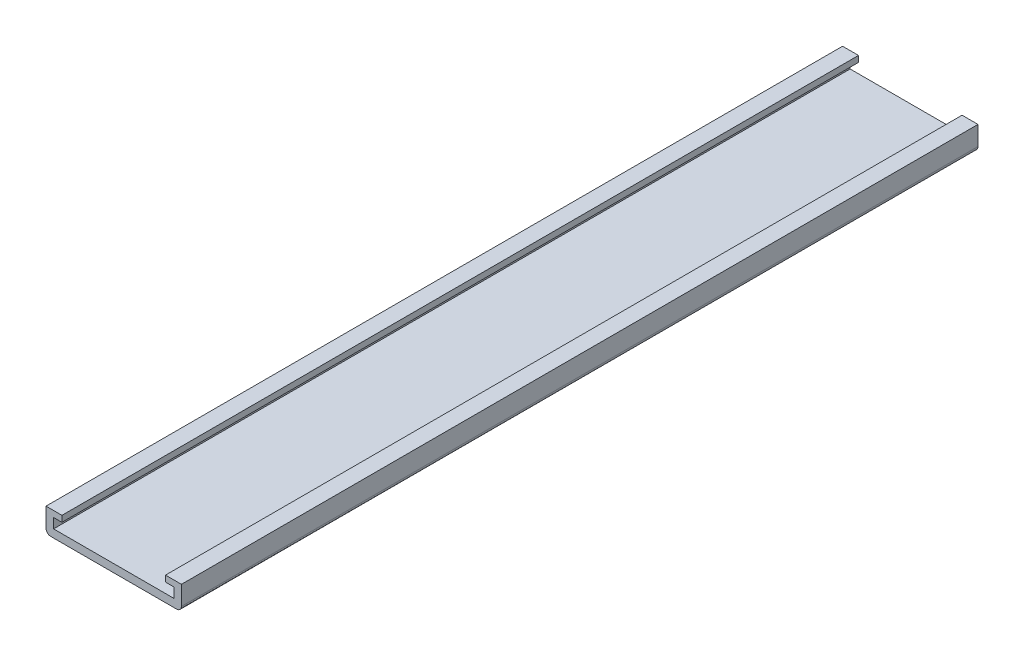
ISO-10303-21;
HEADER;
FILE_DESCRIPTION(('STEP AP214'),'2;1');
FILE_NAME('part.step','',(''),(''),'','','');
FILE_SCHEMA(('AUTOMOTIVE_DESIGN { 1 0 10303 214 1 1 1 1 }'));
ENDSEC;
DATA;
#1=APPLICATION_CONTEXT('core data for automotive mechanical design processes');
#2=APPLICATION_PROTOCOL_DEFINITION('international standard','automotive_design',2000,#1);
#3=PRODUCT_CONTEXT('',#1,'mechanical');
#4=PRODUCT('Part','Part','',(#3));
#5=PRODUCT_RELATED_PRODUCT_CATEGORY('part','',(#4));
#6=PRODUCT_DEFINITION_FORMATION('','',#4);
#7=PRODUCT_DEFINITION_CONTEXT('part definition',#1,'design');
#8=PRODUCT_DEFINITION('design','',#6,#7);
#9=PRODUCT_DEFINITION_SHAPE('','',#8);
#10=(LENGTH_UNIT() NAMED_UNIT(*) SI_UNIT(.MILLI.,.METRE.));
#11=(NAMED_UNIT(*) PLANE_ANGLE_UNIT() SI_UNIT($,.RADIAN.));
#12=(NAMED_UNIT(*) SI_UNIT($,.STERADIAN.) SOLID_ANGLE_UNIT());
#13=UNCERTAINTY_MEASURE_WITH_UNIT(LENGTH_MEASURE(1.E-05),#10,'distance_accuracy_value','');
#14=(GEOMETRIC_REPRESENTATION_CONTEXT(3) GLOBAL_UNCERTAINTY_ASSIGNED_CONTEXT((#13)) GLOBAL_UNIT_ASSIGNED_CONTEXT((#10,
#11,#12)) REPRESENTATION_CONTEXT('',''));
#15=CARTESIAN_POINT('',(0.,0.,0.));
#16=DIRECTION('',(0.,0.,1.));
#17=DIRECTION('',(1.,0.,0.));
#18=AXIS2_PLACEMENT_3D('',#15,#16,#17);
#19=CARTESIAN_POINT('',(42.5,15.,500.));
#20=DIRECTION('',(0.,-1.,0.));
#21=DIRECTION('',(1.,0.,0.));
#22=AXIS2_PLACEMENT_3D('',#19,#20,#21);
#23=PLANE('',#22);
#24=DIRECTION('',(-1.,0.,0.));
#25=VECTOR('',#24,1.);
#26=CARTESIAN_POINT('',(42.5,15.,0.));
#27=LINE('',#26,#25);
#28=CARTESIAN_POINT('',(42.5,15.,0.));
#29=VERTEX_POINT('',#28);
#30=CARTESIAN_POINT('',(32.5,15.,0.));
#31=VERTEX_POINT('',#30);
#32=EDGE_CURVE('E118',#29,#31,#27,.T.);
#33=ORIENTED_EDGE('',*,*,#32,.T.);
#34=DIRECTION('',(0.,0.,-1.));
#35=VECTOR('',#34,1.);
#36=CARTESIAN_POINT('',(32.5,15.,500.));
#37=LINE('',#36,#35);
#38=CARTESIAN_POINT('',(32.5,15.,500.));
#39=VERTEX_POINT('',#38);
#40=EDGE_CURVE('E9',#39,#31,#37,.T.);
#41=ORIENTED_EDGE('',*,*,#40,.F.);
#42=DIRECTION('',(-1.,0.,0.));
#43=VECTOR('',#42,1.);
#44=CARTESIAN_POINT('',(42.5,15.,500.));
#45=LINE('',#44,#43);
#46=CARTESIAN_POINT('',(42.5,15.,500.));
#47=VERTEX_POINT('',#46);
#48=EDGE_CURVE('E157',#47,#39,#45,.T.);
#49=ORIENTED_EDGE('',*,*,#48,.F.);
#50=DIRECTION('',(0.,0.,-1.));
#51=VECTOR('',#50,1.);
#52=CARTESIAN_POINT('',(42.5,15.,500.));
#53=LINE('',#52,#51);
#54=EDGE_CURVE('E131',#47,#29,#53,.T.);
#55=ORIENTED_EDGE('',*,*,#54,.T.);
#56=EDGE_LOOP('',(#33,#41,#49,#55));
#57=FACE_BOUND('',#56,.T.);
#58=ADVANCED_FACE('F14',(#57),#23,.F.);
#59=CARTESIAN_POINT('',(32.5,15.,500.));
#60=DIRECTION('',(1.,0.,0.));
#61=DIRECTION('',(0.,0.,-1.));
#62=AXIS2_PLACEMENT_3D('',#59,#60,#61);
#63=PLANE('',#62);
#64=DIRECTION('',(0.,-1.,0.));
#65=VECTOR('',#64,1.);
#66=CARTESIAN_POINT('',(32.5,15.,0.));
#67=LINE('',#66,#65);
#68=CARTESIAN_POINT('',(32.5,11.2,0.));
#69=VERTEX_POINT('',#68);
#70=EDGE_CURVE('E114',#31,#69,#67,.T.);
#71=ORIENTED_EDGE('',*,*,#70,.T.);
#72=DIRECTION('',(0.,0.,-1.));
#73=VECTOR('',#72,1.);
#74=CARTESIAN_POINT('',(32.5,11.2,500.));
#75=LINE('',#74,#73);
#76=CARTESIAN_POINT('',(32.5,11.2,500.));
#77=VERTEX_POINT('',#76);
#78=EDGE_CURVE('E21',#77,#69,#75,.T.);
#79=ORIENTED_EDGE('',*,*,#78,.F.);
#80=DIRECTION('',(0.,-1.,0.));
#81=VECTOR('',#80,1.);
#82=CARTESIAN_POINT('',(32.5,15.,500.));
#83=LINE('',#82,#81);
#84=EDGE_CURVE('E127',#39,#77,#83,.T.);
#85=ORIENTED_EDGE('',*,*,#84,.F.);
#86=ORIENTED_EDGE('',*,*,#40,.T.);
#87=EDGE_LOOP('',(#71,#79,#85,#86));
#88=FACE_BOUND('',#87,.T.);
#89=ADVANCED_FACE('F126',(#88),#63,.F.);
#90=CARTESIAN_POINT('',(32.5,11.2,500.));
#91=DIRECTION('',(0.,1.,0.));
#92=DIRECTION('',(0.,0.,1.));
#93=AXIS2_PLACEMENT_3D('',#90,#91,#92);
#94=PLANE('',#93);
#95=DIRECTION('',(1.,0.,0.));
#96=VECTOR('',#95,1.);
#97=CARTESIAN_POINT('',(32.5,11.2,0.));
#98=LINE('',#97,#96);
#99=CARTESIAN_POINT('',(37.75,11.2,0.));
#100=VERTEX_POINT('',#99);
#101=EDGE_CURVE('E120',#69,#100,#98,.T.);
#102=ORIENTED_EDGE('',*,*,#101,.T.);
#103=DIRECTION('',(0.,0.,-1.));
#104=VECTOR('',#103,1.);
#105=CARTESIAN_POINT('',(37.75,11.2,500.));
#106=LINE('',#105,#104);
#107=CARTESIAN_POINT('',(37.75,11.2,500.));
#108=VERTEX_POINT('',#107);
#109=EDGE_CURVE('E213',#108,#100,#106,.T.);
#110=ORIENTED_EDGE('',*,*,#109,.F.);
#111=DIRECTION('',(1.,0.,0.));
#112=VECTOR('',#111,1.);
#113=CARTESIAN_POINT('',(32.5,11.2,500.));
#114=LINE('',#113,#112);
#115=EDGE_CURVE('E160',#77,#108,#114,.T.);
#116=ORIENTED_EDGE('',*,*,#115,.F.);
#117=ORIENTED_EDGE('',*,*,#78,.T.);
#118=EDGE_LOOP('',(#102,#110,#116,#117));
#119=FACE_BOUND('',#118,.T.);
#120=ADVANCED_FACE('F217',(#119),#94,.F.);
#121=CARTESIAN_POINT('',(37.75,11.2,500.));
#122=DIRECTION('',(1.,0.,0.));
#123=DIRECTION('',(0.,0.,-1.));
#124=AXIS2_PLACEMENT_3D('',#121,#122,#123);
#125=PLANE('',#124);
#126=DIRECTION('',(0.,-1.,0.));
#127=VECTOR('',#126,1.);
#128=CARTESIAN_POINT('',(37.75,11.2,0.));
#129=LINE('',#128,#127);
#130=CARTESIAN_POINT('',(37.75,5.,0.));
#131=VERTEX_POINT('',#130);
#132=EDGE_CURVE('E135',#100,#131,#129,.T.);
#133=ORIENTED_EDGE('',*,*,#132,.T.);
#134=DIRECTION('',(0.,0.,-1.));
#135=VECTOR('',#134,1.);
#136=CARTESIAN_POINT('',(37.75,5.,500.));
#137=LINE('',#136,#135);
#138=CARTESIAN_POINT('',(37.75,5.,500.));
#139=VERTEX_POINT('',#138);
#140=EDGE_CURVE('E210',#139,#131,#137,.T.);
#141=ORIENTED_EDGE('',*,*,#140,.F.);
#142=DIRECTION('',(0.,-1.,0.));
#143=VECTOR('',#142,1.);
#144=CARTESIAN_POINT('',(37.75,11.2,500.));
#145=LINE('',#144,#143);
#146=EDGE_CURVE('E162',#108,#139,#145,.T.);
#147=ORIENTED_EDGE('',*,*,#146,.F.);
#148=ORIENTED_EDGE('',*,*,#109,.T.);
#149=EDGE_LOOP('',(#133,#141,#147,#148));
#150=FACE_BOUND('',#149,.T.);
#151=ADVANCED_FACE('F225',(#150),#125,.F.);
#152=CARTESIAN_POINT('',(37.75,5.,500.));
#153=DIRECTION('',(0.,-1.,0.));
#154=DIRECTION('',(1.,0.,0.));
#155=AXIS2_PLACEMENT_3D('',#152,#153,#154);
#156=PLANE('',#155);
#157=DIRECTION('',(-1.,0.,0.));
#158=VECTOR('',#157,1.);
#159=CARTESIAN_POINT('',(37.75,5.,0.));
#160=LINE('',#159,#158);
#161=CARTESIAN_POINT('',(-37.75,5.,0.));
#162=VERTEX_POINT('',#161);
#163=EDGE_CURVE('E137',#131,#162,#160,.T.);
#164=ORIENTED_EDGE('',*,*,#163,.T.);
#165=DIRECTION('',(0.,0.,-1.));
#166=VECTOR('',#165,1.);
#167=CARTESIAN_POINT('',(-37.75,5.,500.));
#168=LINE('',#167,#166);
#169=CARTESIAN_POINT('',(-37.75,5.,500.));
#170=VERTEX_POINT('',#169);
#171=EDGE_CURVE('E207',#170,#162,#168,.T.);
#172=ORIENTED_EDGE('',*,*,#171,.F.);
#173=DIRECTION('',(-1.,0.,0.));
#174=VECTOR('',#173,1.);
#175=CARTESIAN_POINT('',(37.75,5.,500.));
#176=LINE('',#175,#174);
#177=EDGE_CURVE('E164',#139,#170,#176,.T.);
#178=ORIENTED_EDGE('',*,*,#177,.F.);
#179=ORIENTED_EDGE('',*,*,#140,.T.);
#180=EDGE_LOOP('',(#164,#172,#178,#179));
#181=FACE_BOUND('',#180,.T.);
#182=ADVANCED_FACE('F228',(#181),#156,.F.);
#183=CARTESIAN_POINT('',(-37.75,5.,500.));
#184=DIRECTION('',(-1.,0.,0.));
#185=DIRECTION('',(0.,0.,1.));
#186=AXIS2_PLACEMENT_3D('',#183,#184,#185);
#187=PLANE('',#186);
#188=DIRECTION('',(0.,1.,0.));
#189=VECTOR('',#188,1.);
#190=CARTESIAN_POINT('',(-37.75,5.,0.));
#191=LINE('',#190,#189);
#192=CARTESIAN_POINT('',(-37.75,11.2,0.));
#193=VERTEX_POINT('',#192);
#194=EDGE_CURVE('E139',#162,#193,#191,.T.);
#195=ORIENTED_EDGE('',*,*,#194,.T.);
#196=DIRECTION('',(0.,0.,-1.));
#197=VECTOR('',#196,1.);
#198=CARTESIAN_POINT('',(-37.75,11.2,500.));
#199=LINE('',#198,#197);
#200=CARTESIAN_POINT('',(-37.75,11.2,500.));
#201=VERTEX_POINT('',#200);
#202=EDGE_CURVE('E204',#201,#193,#199,.T.);
#203=ORIENTED_EDGE('',*,*,#202,.F.);
#204=DIRECTION('',(0.,1.,0.));
#205=VECTOR('',#204,1.);
#206=CARTESIAN_POINT('',(-37.75,5.,500.));
#207=LINE('',#206,#205);
#208=EDGE_CURVE('E166',#170,#201,#207,.T.);
#209=ORIENTED_EDGE('',*,*,#208,.F.);
#210=ORIENTED_EDGE('',*,*,#171,.T.);
#211=EDGE_LOOP('',(#195,#203,#209,#210));
#212=FACE_BOUND('',#211,.T.);
#213=ADVANCED_FACE('F233',(#212),#187,.F.);
#214=CARTESIAN_POINT('',(-37.75,11.2,500.));
#215=DIRECTION('',(0.,1.,0.));
#216=DIRECTION('',(0.,0.,1.));
#217=AXIS2_PLACEMENT_3D('',#214,#215,#216);
#218=PLANE('',#217);
#219=DIRECTION('',(1.,0.,0.));
#220=VECTOR('',#219,1.);
#221=CARTESIAN_POINT('',(-37.75,11.2,0.));
#222=LINE('',#221,#220);
#223=CARTESIAN_POINT('',(-32.5,11.2,0.));
#224=VERTEX_POINT('',#223);
#225=EDGE_CURVE('E141',#193,#224,#222,.T.);
#226=ORIENTED_EDGE('',*,*,#225,.T.);
#227=DIRECTION('',(0.,0.,-1.));
#228=VECTOR('',#227,1.);
#229=CARTESIAN_POINT('',(-32.5,11.2,500.));
#230=LINE('',#229,#228);
#231=CARTESIAN_POINT('',(-32.5,11.2,500.));
#232=VERTEX_POINT('',#231);
#233=EDGE_CURVE('E201',#232,#224,#230,.T.);
#234=ORIENTED_EDGE('',*,*,#233,.F.);
#235=DIRECTION('',(1.,0.,0.));
#236=VECTOR('',#235,1.);
#237=CARTESIAN_POINT('',(-37.75,11.2,500.));
#238=LINE('',#237,#236);
#239=EDGE_CURVE('E168',#201,#232,#238,.T.);
#240=ORIENTED_EDGE('',*,*,#239,.F.);
#241=ORIENTED_EDGE('',*,*,#202,.T.);
#242=EDGE_LOOP('',(#226,#234,#240,#241));
#243=FACE_BOUND('',#242,.T.);
#244=ADVANCED_FACE('F239',(#243),#218,.F.);
#245=CARTESIAN_POINT('',(-32.5,11.2,500.));
#246=DIRECTION('',(-1.,0.,0.));
#247=DIRECTION('',(0.,0.,1.));
#248=AXIS2_PLACEMENT_3D('',#245,#246,#247);
#249=PLANE('',#248);
#250=DIRECTION('',(0.,1.,0.));
#251=VECTOR('',#250,1.);
#252=CARTESIAN_POINT('',(-32.5,11.2,0.));
#253=LINE('',#252,#251);
#254=CARTESIAN_POINT('',(-32.5,15.,0.));
#255=VERTEX_POINT('',#254);
#256=EDGE_CURVE('E143',#224,#255,#253,.T.);
#257=ORIENTED_EDGE('',*,*,#256,.T.);
#258=DIRECTION('',(0.,0.,-1.));
#259=VECTOR('',#258,1.);
#260=CARTESIAN_POINT('',(-32.5,15.,500.));
#261=LINE('',#260,#259);
#262=CARTESIAN_POINT('',(-32.5,15.,500.));
#263=VERTEX_POINT('',#262);
#264=EDGE_CURVE('E198',#263,#255,#261,.T.);
#265=ORIENTED_EDGE('',*,*,#264,.F.);
#266=DIRECTION('',(0.,1.,0.));
#267=VECTOR('',#266,1.);
#268=CARTESIAN_POINT('',(-32.5,11.2,500.));
#269=LINE('',#268,#267);
#270=EDGE_CURVE('E170',#232,#263,#269,.T.);
#271=ORIENTED_EDGE('',*,*,#270,.F.);
#272=ORIENTED_EDGE('',*,*,#233,.T.);
#273=EDGE_LOOP('',(#257,#265,#271,#272));
#274=FACE_BOUND('',#273,.T.);
#275=ADVANCED_FACE('F243',(#274),#249,.F.);
#276=CARTESIAN_POINT('',(-32.5,15.,500.));
#277=DIRECTION('',(0.,-1.,0.));
#278=DIRECTION('',(1.,0.,0.));
#279=AXIS2_PLACEMENT_3D('',#276,#277,#278);
#280=PLANE('',#279);
#281=DIRECTION('',(-1.,0.,0.));
#282=VECTOR('',#281,1.);
#283=CARTESIAN_POINT('',(-32.5,15.,0.));
#284=LINE('',#283,#282);
#285=CARTESIAN_POINT('',(-42.5,15.,0.));
#286=VERTEX_POINT('',#285);
#287=EDGE_CURVE('E145',#255,#286,#284,.T.);
#288=ORIENTED_EDGE('',*,*,#287,.T.);
#289=DIRECTION('',(0.,0.,-1.));
#290=VECTOR('',#289,1.);
#291=CARTESIAN_POINT('',(-42.5,15.,500.));
#292=LINE('',#291,#290);
#293=CARTESIAN_POINT('',(-42.5,15.,500.));
#294=VERTEX_POINT('',#293);
#295=EDGE_CURVE('E195',#294,#286,#292,.T.);
#296=ORIENTED_EDGE('',*,*,#295,.F.);
#297=DIRECTION('',(-1.,0.,0.));
#298=VECTOR('',#297,1.);
#299=CARTESIAN_POINT('',(-32.5,15.,500.));
#300=LINE('',#299,#298);
#301=EDGE_CURVE('E172',#263,#294,#300,.T.);
#302=ORIENTED_EDGE('',*,*,#301,.F.);
#303=ORIENTED_EDGE('',*,*,#264,.T.);
#304=EDGE_LOOP('',(#288,#296,#302,#303));
#305=FACE_BOUND('',#304,.T.);
#306=ADVANCED_FACE('F248',(#305),#280,.F.);
#307=CARTESIAN_POINT('',(-42.5,15.,500.));
#308=DIRECTION('',(1.,0.,0.));
#309=DIRECTION('',(0.,0.,-1.));
#310=AXIS2_PLACEMENT_3D('',#307,#308,#309);
#311=PLANE('',#310);
#312=DIRECTION('',(0.,-1.,0.));
#313=VECTOR('',#312,1.);
#314=CARTESIAN_POINT('',(-42.5,15.,0.));
#315=LINE('',#314,#313);
#316=CARTESIAN_POINT('',(-42.5,3.,0.));
#317=VERTEX_POINT('',#316);
#318=EDGE_CURVE('E147',#286,#317,#315,.T.);
#319=ORIENTED_EDGE('',*,*,#318,.T.);
#320=DIRECTION('',(0.,0.,-1.));
#321=VECTOR('',#320,1.);
#322=CARTESIAN_POINT('',(-42.5,3.,500.));
#323=LINE('',#322,#321);
#324=CARTESIAN_POINT('',(-42.5,3.,500.));
#325=VERTEX_POINT('',#324);
#326=EDGE_CURVE('E192',#325,#317,#323,.T.);
#327=ORIENTED_EDGE('',*,*,#326,.F.);
#328=DIRECTION('',(0.,-1.,0.));
#329=VECTOR('',#328,1.);
#330=CARTESIAN_POINT('',(-42.5,15.,500.));
#331=LINE('',#330,#329);
#332=EDGE_CURVE('E174',#294,#325,#331,.T.);
#333=ORIENTED_EDGE('',*,*,#332,.F.);
#334=ORIENTED_EDGE('',*,*,#295,.T.);
#335=EDGE_LOOP('',(#319,#327,#333,#334));
#336=FACE_BOUND('',#335,.T.);
#337=ADVANCED_FACE('F254',(#336),#311,.F.);
#338=CARTESIAN_POINT('',(-39.5,3.,500.));
#339=DIRECTION('',(0.,0.,-1.));
#340=DIRECTION('',(-1.,0.,0.));
#341=AXIS2_PLACEMENT_3D('',#338,#339,#340);
#342=CYLINDRICAL_SURFACE('',#341,3.);
#343=CARTESIAN_POINT('',(-39.5,3.,0.));
#344=DIRECTION('',(0.,0.,1.));
#345=DIRECTION('',(1.,0.,0.));
#346=AXIS2_PLACEMENT_3D('',#343,#344,#345);
#347=CIRCLE('',#346,3.);
#348=CARTESIAN_POINT('',(-39.5,0.,0.));
#349=VERTEX_POINT('',#348);
#350=EDGE_CURVE('E149',#317,#349,#347,.T.);
#351=ORIENTED_EDGE('',*,*,#350,.T.);
#352=DIRECTION('',(0.,0.,-1.));
#353=VECTOR('',#352,1.);
#354=CARTESIAN_POINT('',(-39.5,0.,500.));
#355=LINE('',#354,#353);
#356=CARTESIAN_POINT('',(-39.5,0.,500.));
#357=VERTEX_POINT('',#356);
#358=EDGE_CURVE('E189',#357,#349,#355,.T.);
#359=ORIENTED_EDGE('',*,*,#358,.F.);
#360=CARTESIAN_POINT('',(-39.5,3.,500.));
#361=DIRECTION('',(0.,0.,1.));
#362=DIRECTION('',(1.,0.,0.));
#363=AXIS2_PLACEMENT_3D('',#360,#361,#362);
#364=CIRCLE('',#363,3.);
#365=EDGE_CURVE('E176',#325,#357,#364,.T.);
#366=ORIENTED_EDGE('',*,*,#365,.F.);
#367=ORIENTED_EDGE('',*,*,#326,.T.);
#368=EDGE_LOOP('',(#351,#359,#366,#367));
#369=FACE_BOUND('',#368,.T.);
#370=ADVANCED_FACE('F258',(#369),#342,.T.);
#371=CARTESIAN_POINT('',(-39.5,0.,500.));
#372=DIRECTION('',(0.,1.,0.));
#373=DIRECTION('',(0.,0.,1.));
#374=AXIS2_PLACEMENT_3D('',#371,#372,#373);
#375=PLANE('',#374);
#376=DIRECTION('',(1.,0.,0.));
#377=VECTOR('',#376,1.);
#378=CARTESIAN_POINT('',(-39.5,0.,0.));
#379=LINE('',#378,#377);
#380=CARTESIAN_POINT('',(39.5,0.,0.));
#381=VERTEX_POINT('',#380);
#382=EDGE_CURVE('E151',#349,#381,#379,.T.);
#383=ORIENTED_EDGE('',*,*,#382,.T.);
#384=DIRECTION('',(0.,0.,-1.));
#385=VECTOR('',#384,1.);
#386=CARTESIAN_POINT('',(39.5,0.,500.));
#387=LINE('',#386,#385);
#388=CARTESIAN_POINT('',(39.5,0.,500.));
#389=VERTEX_POINT('',#388);
#390=EDGE_CURVE('E186',#389,#381,#387,.T.);
#391=ORIENTED_EDGE('',*,*,#390,.F.);
#392=DIRECTION('',(1.,0.,0.));
#393=VECTOR('',#392,1.);
#394=CARTESIAN_POINT('',(-39.5,0.,500.));
#395=LINE('',#394,#393);
#396=EDGE_CURVE('E178',#357,#389,#395,.T.);
#397=ORIENTED_EDGE('',*,*,#396,.F.);
#398=ORIENTED_EDGE('',*,*,#358,.T.);
#399=EDGE_LOOP('',(#383,#391,#397,#398));
#400=FACE_BOUND('',#399,.T.);
#401=ADVANCED_FACE('F263',(#400),#375,.F.);
#402=CARTESIAN_POINT('',(39.5,3.,500.));
#403=DIRECTION('',(0.,0.,-1.));
#404=DIRECTION('',(-1.,0.,0.));
#405=AXIS2_PLACEMENT_3D('',#402,#403,#404);
#406=CYLINDRICAL_SURFACE('',#405,3.);
#407=CARTESIAN_POINT('',(39.5,3.,0.));
#408=DIRECTION('',(0.,0.,1.));
#409=DIRECTION('',(1.,0.,0.));
#410=AXIS2_PLACEMENT_3D('',#407,#408,#409);
#411=CIRCLE('',#410,3.);
#412=CARTESIAN_POINT('',(42.5,3.,0.));
#413=VERTEX_POINT('',#412);
#414=EDGE_CURVE('E153',#381,#413,#411,.T.);
#415=ORIENTED_EDGE('',*,*,#414,.T.);
#416=DIRECTION('',(0.,0.,-1.));
#417=VECTOR('',#416,1.);
#418=CARTESIAN_POINT('',(42.5,3.,500.));
#419=LINE('',#418,#417);
#420=CARTESIAN_POINT('',(42.5,3.,500.));
#421=VERTEX_POINT('',#420);
#422=EDGE_CURVE('E183',#421,#413,#419,.T.);
#423=ORIENTED_EDGE('',*,*,#422,.F.);
#424=CARTESIAN_POINT('',(39.5,3.,500.));
#425=DIRECTION('',(0.,0.,1.));
#426=DIRECTION('',(1.,0.,0.));
#427=AXIS2_PLACEMENT_3D('',#424,#425,#426);
#428=CIRCLE('',#427,3.);
#429=EDGE_CURVE('E33',#389,#421,#428,.T.);
#430=ORIENTED_EDGE('',*,*,#429,.F.);
#431=ORIENTED_EDGE('',*,*,#390,.T.);
#432=EDGE_LOOP('',(#415,#423,#430,#431));
#433=FACE_BOUND('',#432,.T.);
#434=ADVANCED_FACE('F266',(#433),#406,.T.);
#435=CARTESIAN_POINT('',(42.5,3.,500.));
#436=DIRECTION('',(-1.,0.,0.));
#437=DIRECTION('',(0.,0.,1.));
#438=AXIS2_PLACEMENT_3D('',#435,#436,#437);
#439=PLANE('',#438);
#440=DIRECTION('',(0.,1.,0.));
#441=VECTOR('',#440,1.);
#442=CARTESIAN_POINT('',(42.5,3.,0.));
#443=LINE('',#442,#441);
#444=EDGE_CURVE('E155',#413,#29,#443,.T.);
#445=ORIENTED_EDGE('',*,*,#444,.T.);
#446=ORIENTED_EDGE('',*,*,#54,.F.);
#447=DIRECTION('',(0.,1.,0.));
#448=VECTOR('',#447,1.);
#449=CARTESIAN_POINT('',(42.5,3.,500.));
#450=LINE('',#449,#448);
#451=EDGE_CURVE('E28',#421,#47,#450,.T.);
#452=ORIENTED_EDGE('',*,*,#451,.F.);
#453=ORIENTED_EDGE('',*,*,#422,.T.);
#454=EDGE_LOOP('',(#445,#446,#452,#453));
#455=FACE_BOUND('',#454,.T.);
#456=ADVANCED_FACE('F268',(#455),#439,.F.);
#457=CARTESIAN_POINT('',(-39.5,3.,500.));
#458=DIRECTION('',(0.,0.,1.));
#459=DIRECTION('',(1.,0.,0.));
#460=AXIS2_PLACEMENT_3D('',#457,#458,#459);
#461=PLANE('',#460);
#462=ORIENTED_EDGE('',*,*,#48,.T.);
#463=ORIENTED_EDGE('',*,*,#84,.T.);
#464=ORIENTED_EDGE('',*,*,#115,.T.);
#465=ORIENTED_EDGE('',*,*,#146,.T.);
#466=ORIENTED_EDGE('',*,*,#177,.T.);
#467=ORIENTED_EDGE('',*,*,#208,.T.);
#468=ORIENTED_EDGE('',*,*,#239,.T.);
#469=ORIENTED_EDGE('',*,*,#270,.T.);
#470=ORIENTED_EDGE('',*,*,#301,.T.);
#471=ORIENTED_EDGE('',*,*,#332,.T.);
#472=ORIENTED_EDGE('',*,*,#365,.T.);
#473=ORIENTED_EDGE('',*,*,#396,.T.);
#474=ORIENTED_EDGE('',*,*,#429,.T.);
#475=ORIENTED_EDGE('',*,*,#451,.T.);
#476=EDGE_LOOP('',(#462,#463,#464,#465,#466,#467,#468,#469,#470,#471,#472,#473,#474,#475));
#477=FACE_BOUND('',#476,.T.);
#478=ADVANCED_FACE('F220',(#477),#461,.T.);
#479=CARTESIAN_POINT('',(-39.5,3.,0.));
#480=DIRECTION('',(0.,0.,1.));
#481=DIRECTION('',(1.,0.,0.));
#482=AXIS2_PLACEMENT_3D('',#479,#480,#481);
#483=PLANE('',#482);
#484=ORIENTED_EDGE('',*,*,#32,.F.);
#485=ORIENTED_EDGE('',*,*,#444,.F.);
#486=ORIENTED_EDGE('',*,*,#414,.F.);
#487=ORIENTED_EDGE('',*,*,#382,.F.);
#488=ORIENTED_EDGE('',*,*,#350,.F.);
#489=ORIENTED_EDGE('',*,*,#318,.F.);
#490=ORIENTED_EDGE('',*,*,#287,.F.);
#491=ORIENTED_EDGE('',*,*,#256,.F.);
#492=ORIENTED_EDGE('',*,*,#225,.F.);
#493=ORIENTED_EDGE('',*,*,#194,.F.);
#494=ORIENTED_EDGE('',*,*,#163,.F.);
#495=ORIENTED_EDGE('',*,*,#132,.F.);
#496=ORIENTED_EDGE('',*,*,#101,.F.);
#497=ORIENTED_EDGE('',*,*,#70,.F.);
#498=EDGE_LOOP('',(#484,#485,#486,#487,#488,#489,#490,#491,#492,#493,#494,#495,#496,#497));
#499=FACE_BOUND('',#498,.T.);
#500=ADVANCED_FACE('F115',(#499),#483,.F.);
#501=CLOSED_SHELL('',(#58,#89,#120,#151,#182,#213,#244,#275,#306,#337,#370,#401,#434,#456,#478,#500));
#502=MANIFOLD_SOLID_BREP('B1',#501);
#503=ADVANCED_BREP_SHAPE_REPRESENTATION('',(#18,#502),#14);
#504=SHAPE_DEFINITION_REPRESENTATION(#9,#503);
ENDSEC;
END-ISO-10303-21;
